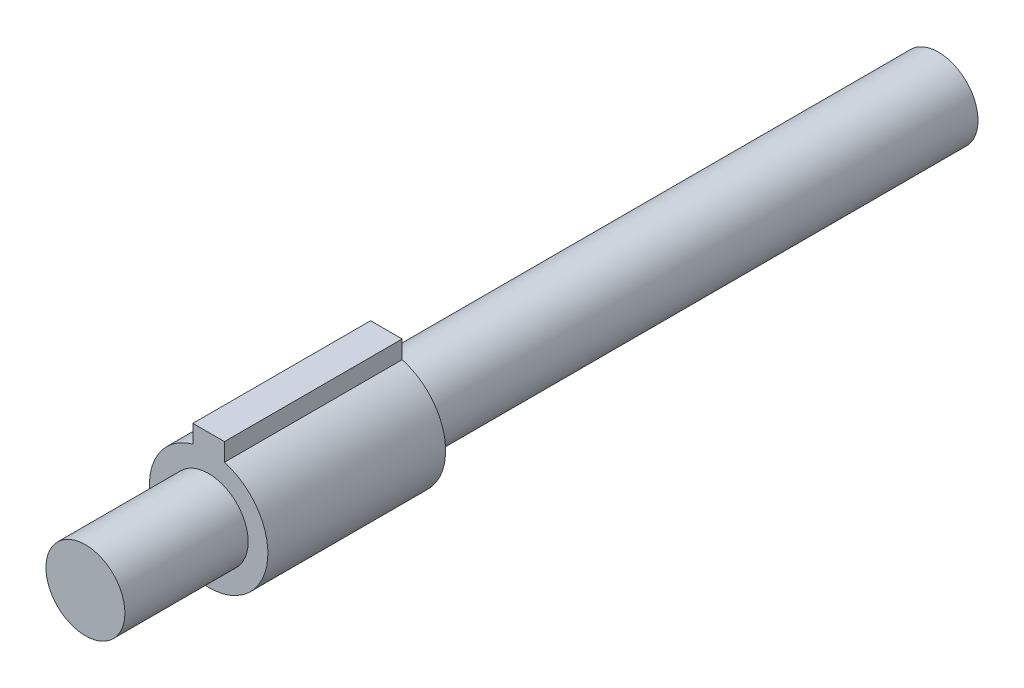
from build123d import *

# Parameters (mm, degrees)
BOSS_EXTRUDE1_DEPTH = 57.15
SKETCH3_R           = 12.7
BOSS_EXTRUDE2_DEPTH = 39.624
BOSS_EXTRUDE3_START = 177.546
SKETCH4_R           = 12.7
BOSS_EXTRUDE3_DEPTH = 177.546


with BuildPart() as part:
    # Sketch2 → Boss-Extrude1 (new body)
    with BuildSketch(Plane.XY):
        with BuildLine():
            Line((5.08, 24.13), (-5.08, 24.13))
            Line((-5.08, 24.13), (-5.08, 18.360177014))
            ThreePointArc((-5.08, 18.360177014), (0, -19.05), (5.08, 18.360177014))
            Line((5.08, 18.360177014), (5.08, 24.13))
        make_face()
    extrude(amount=BOSS_EXTRUDE1_DEPTH)

    # Sketch3 → Boss-Extrude2 (add)
    with BuildSketch(Plane.XY.offset(57.15)):
        Circle(SKETCH3_R)
    extrude(amount=BOSS_EXTRUDE2_DEPTH)

    # Sketch4 → Boss-Extrude3 (add)
    with BuildSketch(Plane(origin=(0, 0, 0), x_dir=(-1, 0, 0), z_dir=(0, 0, -1)).offset(BOSS_EXTRUDE3_START)):
        with Locations(Location((0, 0, 0), (0, 0, 180))):
            Circle(SKETCH4_R)
    extrude(amount=-BOSS_EXTRUDE3_DEPTH)


solid = part.part
